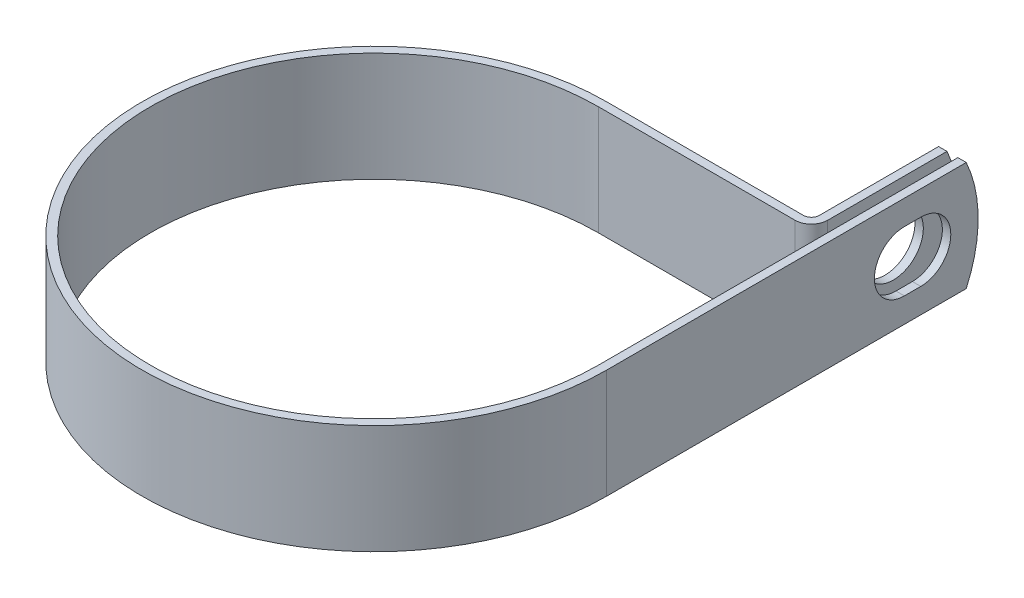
from build123d import *

# Parameters (mm, degrees)
EXTRUDE_THIN1_DEPTH = 7.9375
SKETCH2_R           = 4.3561
CUT_EXTRUDE1_DEPTH  = 1.2192
CUT_EXTRUDE2_REACH  = 88.801
CUT_EXTRUDE3_DEPTH  = 84.717110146


with BuildPart() as part:
    # Sketch1 → Extrude-Thin1 (new, symmetric)
    with BuildSketch(Plane(origin=(0, 0, 0), x_dir=(1, 0, 0), z_dir=(0, 1, 0))):
        with BuildLine():
            Line((32.5374, 53.975), (32.5374, 32.5374))
            Line((32.5374, 32.5374), (32.5374, 0))
            ThreePointArc((32.5374, 0), (-23.007416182, -23.007416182), (0, 32.5374))
            Line((0, 32.5374), (28.58516, 32.5374))
            ThreePointArc((28.58516, 32.5374), (30.266263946, 33.233736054), (30.9626, 34.91484))
            Line((30.9626, 34.91484), (30.9626, 53.975))
            Line((30.9626, 53.975), (29.7434, 53.975))
            Line((29.7434, 53.975), (29.7434, 34.91484))
            ThreePointArc((29.7434, 34.91484), (29.404159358, 34.095840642), (28.58516, 33.7566))
            Line((28.58516, 33.7566), (0, 33.7566))
            ThreePointArc((0, 33.7566), (-23.86952077, -23.86952077), (33.7566, 0))
            Line((33.7566, 0), (33.7566, 32.5374))
            Line((33.7566, 32.5374), (33.7566, 53.975))
            Line((33.7566, 53.975), (32.5374, 53.975))
        make_face()
    extrude(amount=EXTRUDE_THIN1_DEPTH, both=True)

    # Sketch2 → Cut-Extrude1 (cut)
    with BuildSketch(Plane.ZY.offset(-29.7434)):
        with Locations((-44.45, 0)):
            Circle(SKETCH2_R)
    extrude(amount=-CUT_EXTRUDE1_DEPTH, mode=Mode.SUBTRACT)

    # Sketch3 → Cut-Extrude2 (cut, up to next)
    with BuildSketch(Plane(origin=(33.7566, 0, 0), x_dir=(0, 0, -1), z_dir=(1, 0, 0)), mode=Mode.PRIVATE) as cut_extrude2_sk1:
        with BuildLine():
            Line((43.2562, 4.3561), (45.6438, 4.3561))
            ThreePointArc((45.6438, 4.3561), (49.9999, 0), (45.6438, -4.3561))
            Line((45.6438, -4.3561), (43.2562, -4.3561))
            ThreePointArc((43.2562, -4.3561), (38.9001, 0), (43.2562, 4.3561))
        make_face()
    cut_extrude2_tool1 = extrude(cut_extrude2_sk1.sketch, amount=-CUT_EXTRUDE2_REACH, mode=Mode.PRIVATE) & part.part
    add(cut_extrude2_tool1.solids().sort_by_distance((33.7566, 0, -44.45))[0], mode=Mode.SUBTRACT)

    # Sketch4 → Cut-Extrude3 (cut, through all)
    with BuildSketch(Plane.ZY.offset(-29.7434)):
        with BuildLine():
            Line((-52.242580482, 7.9375), (-53.975, 7.9375))
            Line((-53.975, 7.9375), (-53.975, 9.6e-08))
            ThreePointArc((-53.975, 9.6e-08), (-53.536856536, 4.062178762), (-52.242580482, 7.9375))
        make_face()
        with BuildLine():
            ThreePointArc((-52.242580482, -7.9375), (-53.536856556, -4.062178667), (-53.975, 9.6e-08))
            Line((-53.975, 9.6e-08), (-53.975, -7.9375))
            Line((-53.975, -7.9375), (-52.242580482, -7.9375))
        make_face()
    extrude(amount=-CUT_EXTRUDE3_DEPTH, mode=Mode.SUBTRACT)


solid = part.part
